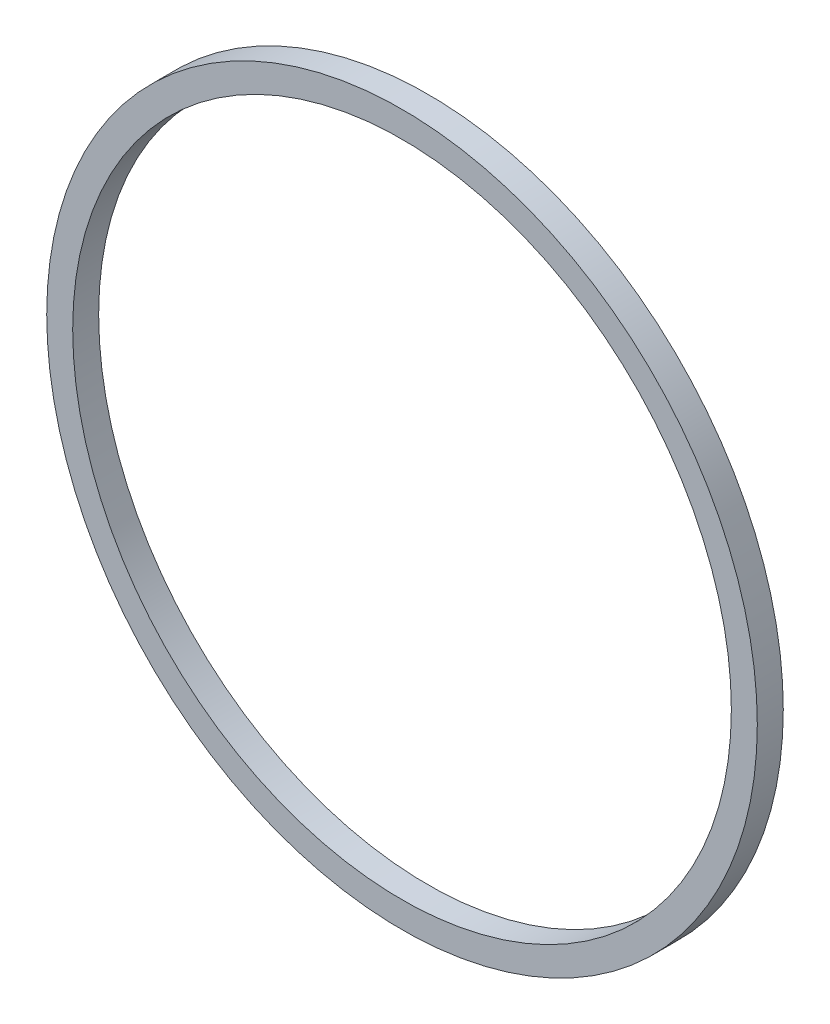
ISO-10303-21;
HEADER;
FILE_DESCRIPTION(('STEP AP214'),'2;1');
FILE_NAME('part.step','',(''),(''),'','','');
FILE_SCHEMA(('AUTOMOTIVE_DESIGN { 1 0 10303 214 1 1 1 1 }'));
ENDSEC;
DATA;
#1=APPLICATION_CONTEXT('core data for automotive mechanical design processes');
#2=APPLICATION_PROTOCOL_DEFINITION('international standard','automotive_design',2000,#1);
#3=PRODUCT_CONTEXT('',#1,'mechanical');
#4=PRODUCT('Part','Part','',(#3));
#5=PRODUCT_RELATED_PRODUCT_CATEGORY('part','',(#4));
#6=PRODUCT_DEFINITION_FORMATION('','',#4);
#7=PRODUCT_DEFINITION_CONTEXT('part definition',#1,'design');
#8=PRODUCT_DEFINITION('design','',#6,#7);
#9=PRODUCT_DEFINITION_SHAPE('','',#8);
#10=(LENGTH_UNIT() NAMED_UNIT(*) SI_UNIT(.MILLI.,.METRE.));
#11=(NAMED_UNIT(*) PLANE_ANGLE_UNIT() SI_UNIT($,.RADIAN.));
#12=(NAMED_UNIT(*) SI_UNIT($,.STERADIAN.) SOLID_ANGLE_UNIT());
#13=UNCERTAINTY_MEASURE_WITH_UNIT(LENGTH_MEASURE(1.E-05),#10,'distance_accuracy_value','');
#14=(GEOMETRIC_REPRESENTATION_CONTEXT(3) GLOBAL_UNCERTAINTY_ASSIGNED_CONTEXT((#13)) GLOBAL_UNIT_ASSIGNED_CONTEXT((#10,
#11,#12)) REPRESENTATION_CONTEXT('',''));
#15=CARTESIAN_POINT('',(0.,0.,0.));
#16=DIRECTION('',(0.,0.,1.));
#17=DIRECTION('',(1.,0.,0.));
#18=AXIS2_PLACEMENT_3D('',#15,#16,#17);
#19=CARTESIAN_POINT('',(88.5825,0.,3.4925));
#20=DIRECTION('',(0.,0.,1.));
#21=DIRECTION('',(1.,0.,0.));
#22=AXIS2_PLACEMENT_3D('',#19,#20,#21);
#23=PLANE('',#22);
#24=CARTESIAN_POINT('',(0.,0.,3.4925));
#25=DIRECTION('',(0.,0.,1.));
#26=DIRECTION('',(1.,0.,0.));
#27=AXIS2_PLACEMENT_3D('',#24,#25,#26);
#28=CIRCLE('',#27,95.5675);
#29=CARTESIAN_POINT('',(95.5675,0.,3.4925));
#30=VERTEX_POINT('',#29);
#31=EDGE_CURVE('E10',#30,#30,#28,.T.);
#32=ORIENTED_EDGE('',*,*,#31,.T.);
#33=EDGE_LOOP('',(#32));
#34=FACE_BOUND('',#33,.T.);
#35=CARTESIAN_POINT('',(0.,0.,3.4925));
#36=DIRECTION('',(0.,0.,1.));
#37=DIRECTION('',(1.,0.,0.));
#38=AXIS2_PLACEMENT_3D('',#35,#36,#37);
#39=CIRCLE('',#38,88.5825);
#40=CARTESIAN_POINT('',(88.5825,0.,3.4925));
#41=VERTEX_POINT('',#40);
#42=EDGE_CURVE('E46',#41,#41,#39,.T.);
#43=ORIENTED_EDGE('',*,*,#42,.F.);
#44=EDGE_LOOP('',(#43));
#45=FACE_BOUND('',#44,.T.);
#46=ADVANCED_FACE('F32',(#34,#45),#23,.T.);
#47=CARTESIAN_POINT('',(0.,0.,3.4925));
#48=DIRECTION('',(0.,0.,1.));
#49=DIRECTION('',(1.,0.,0.));
#50=AXIS2_PLACEMENT_3D('',#47,#48,#49);
#51=CYLINDRICAL_SURFACE('',#50,95.5675);
#52=CARTESIAN_POINT('',(0.,0.,-3.4925));
#53=DIRECTION('',(0.,0.,1.));
#54=DIRECTION('',(1.,0.,0.));
#55=AXIS2_PLACEMENT_3D('',#52,#53,#54);
#56=CIRCLE('',#55,95.5675);
#57=CARTESIAN_POINT('',(95.5675,0.,-3.4925));
#58=VERTEX_POINT('',#57);
#59=EDGE_CURVE('E38',#58,#58,#56,.T.);
#60=ORIENTED_EDGE('',*,*,#59,.T.);
#61=EDGE_LOOP('',(#60));
#62=FACE_BOUND('',#61,.T.);
#63=ORIENTED_EDGE('',*,*,#31,.F.);
#64=EDGE_LOOP('',(#63));
#65=FACE_BOUND('',#64,.T.);
#66=ADVANCED_FACE('F56',(#62,#65),#51,.T.);
#67=CARTESIAN_POINT('',(88.5825,0.,-3.4925));
#68=DIRECTION('',(0.,0.,-1.));
#69=DIRECTION('',(-1.,0.,0.));
#70=AXIS2_PLACEMENT_3D('',#67,#68,#69);
#71=PLANE('',#70);
#72=CARTESIAN_POINT('',(0.,0.,-3.4925));
#73=DIRECTION('',(0.,0.,1.));
#74=DIRECTION('',(1.,0.,0.));
#75=AXIS2_PLACEMENT_3D('',#72,#73,#74);
#76=CIRCLE('',#75,88.5825);
#77=CARTESIAN_POINT('',(88.5825,0.,-3.4925));
#78=VERTEX_POINT('',#77);
#79=EDGE_CURVE('E42',#78,#78,#76,.T.);
#80=ORIENTED_EDGE('',*,*,#79,.T.);
#81=EDGE_LOOP('',(#80));
#82=FACE_BOUND('',#81,.T.);
#83=ORIENTED_EDGE('',*,*,#59,.F.);
#84=EDGE_LOOP('',(#83));
#85=FACE_BOUND('',#84,.T.);
#86=ADVANCED_FACE('F60',(#82,#85),#71,.T.);
#87=CARTESIAN_POINT('',(0.,0.,3.4925));
#88=DIRECTION('',(0.,0.,1.));
#89=DIRECTION('',(1.,0.,0.));
#90=AXIS2_PLACEMENT_3D('',#87,#88,#89);
#91=CYLINDRICAL_SURFACE('',#90,88.5825);
#92=ORIENTED_EDGE('',*,*,#42,.T.);
#93=EDGE_LOOP('',(#92));
#94=FACE_BOUND('',#93,.T.);
#95=ORIENTED_EDGE('',*,*,#79,.F.);
#96=EDGE_LOOP('',(#95));
#97=FACE_BOUND('',#96,.T.);
#98=ADVANCED_FACE('F52',(#94,#97),#91,.F.);
#99=CLOSED_SHELL('',(#46,#66,#86,#98));
#100=MANIFOLD_SOLID_BREP('B2',#99);
#101=ADVANCED_BREP_SHAPE_REPRESENTATION('',(#18,#100),#14);
#102=SHAPE_DEFINITION_REPRESENTATION(#9,#101);
ENDSEC;
END-ISO-10303-21;
